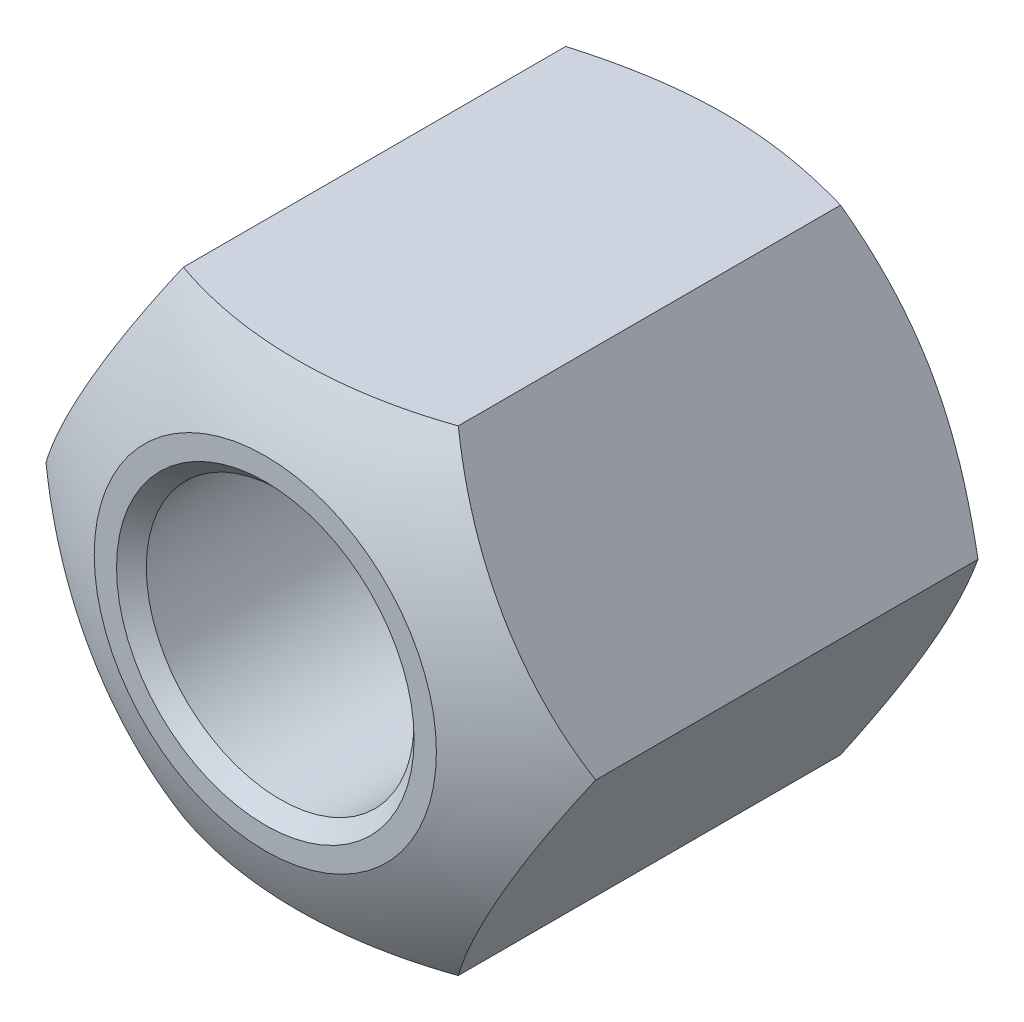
from build123d import *

# Parameters (mm, degrees)
SKETCH1_R     = 4.5
BASENUT_DEPTH = 16.35
CHAMFER1_SIZE = 0.5


with BuildPart() as part:
    # Sketch1 → BaseNut (new body)
    with BuildSketch(Plane.XY):
        Polygon((4.618802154, -8), (9.237604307, 0), (4.618802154, 8), (-4.618802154, 8), (-9.237604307, 0), (-4.618802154, -8), align=None)
        Circle(SKETCH1_R, mode=Mode.SUBTRACT)
    extrude(amount=-BASENUT_DEPTH)

    # Sketch2 → EndChamfer1 (revolve, cut)
    with BuildSketch(Plane(origin=(-4.377633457, 0, -4.85997085), x_dir=(0, 0, 1), z_dir=(0, 1, 0)), mode=Mode.PRIVATE) as endchamfer1_sk:
        with BuildLine():
            Line((2.992824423, 13.615237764), (4.85997085, 13.615237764))
            Line((4.85997085, 13.615237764), (4.85997085, 10.127633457))
            ThreePointArc((4.85997085, 10.127633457), (4.03460032, 11.9293637), (2.992824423, 13.615237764))
        make_face()
    revolve(endchamfer1_sk.sketch.rotate(Axis((0, 0, -14.951953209), (0, 0, 1)), 180), axis=Axis((0, 0, -14.951953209), (0, 0, 1)), mode=Mode.SUBTRACT)

    # Sketch3 → EndChamfer2 (revolve, cut)
    with BuildSketch(Plane(origin=(-4.618802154, 0, -4.618802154), x_dir=(0, 0, 1), z_dir=(0, 1, 0))):
        Polygon((-11.731197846, 11.02450339), (-11.731197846, 13.856406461), (-10.096197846, 13.856406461), align=None)
    revolve(axis=Axis((0, 0, 4.805328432), (0, 0, -1)), mode=Mode.SUBTRACT)

    # Chamfer1
    chamfer1_edges = [part.edges().sort_by_distance(p)[0] for p in [
        (-4.5, 0, -16.35),
        (-4.5, 0, 0),
    ]]
    chamfer(chamfer1_edges, length=CHAMFER1_SIZE)


solid = part.part
